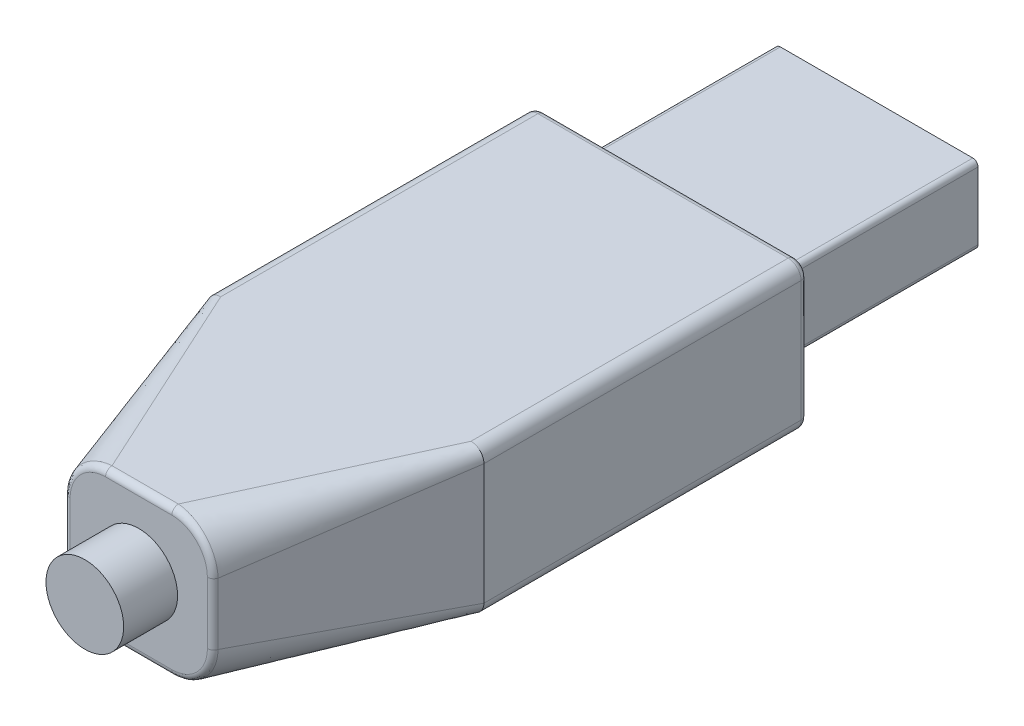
from build123d import *

# Parameters (mm, degrees)
SKETCH14_R           = 2.286
BOSS_EXTRUDE11_DEPTH = 3.175
BOSS_EXTRUDE13_DEPTH = 19.05
SKETCH24_W           = 11.938
SKETCH24_H           = 4.572
BOSS_EXTRUDE14_DEPTH = 12.192
SKETCH25_W           = 11.43
SKETCH25_H           = 2.286
CUT_EXTRUDE3_DEPTH   = 10.16
FILLET8_R            = 0.381
FILLET9_R            = 0.381
FILLET11_R           = 0.3048


with BuildPart() as part:
    # Sketch14 → Boss-Extrude11 (new body)
    with BuildSketch(Plane(origin=(0, 0, 101.6), x_dir=(0.9999999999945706, 3.2953024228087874e-06, 0), z_dir=(0, 2.2118574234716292e-10, 1.0))):
        with Locations(Location((-114.300004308, 16.1798, 0), (0, 0, 269.999811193))):
            Circle(SKETCH14_R)
    extrude(amount=-BOSS_EXTRUDE11_DEPTH)

    # Sketch21 for Boss-Loft1 → Boss-Loft1 section 0
    with BuildSketch(Plane(origin=(0, 2.2e-08, 98.425), x_dir=(-1, 0, 0), z_dir=(0, -2.2118574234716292e-10, -1.0))):
        with BuildLine():
            Line((112.522057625, 20.497423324), (116.078057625, 20.497423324))
            # circular arc as an exact rational Bezier (weights 1, cos(half-angle), 1)
            Bezier((116.078057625, 20.497423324), (118.618057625, 20.497423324), (118.618057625, 17.957423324), weights=[1, 0.707106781, 1])
            Line((118.618057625, 17.957423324), (118.618057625, 14.401423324))
            Bezier((118.618057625, 14.401423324), (118.618057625, 11.861423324), (116.078057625, 11.861423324), weights=[1, 0.707106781, 1])
            Line((116.078057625, 11.861423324), (112.522057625, 11.861423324))
            Bezier((112.522057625, 11.861423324), (109.982057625, 11.861423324), (109.982057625, 14.401423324), weights=[1, 0.707106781, 1])
            Line((109.982057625, 14.401423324), (109.982057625, 17.957423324))
            Bezier((109.982057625, 17.957423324), (109.982057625, 20.497423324), (112.522057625, 20.497423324), weights=[1, 0.707106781, 1])
        make_face()
    # Sketch22 for Boss-Loft1 → Boss-Loft1 section 1
    with BuildSketch(Plane(origin=(0, 1.9e-08, 86.233), x_dir=(-1, 0, 0), z_dir=(0, -2.2118574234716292e-10, -1.0))):
        with BuildLine():
            Line((106.934057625, 20.497423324), (121.666057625, 20.497423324))
            Bezier((121.666057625, 20.497423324), (122.428057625, 20.497423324), (122.428057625, 19.735423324), weights=[1, 0.707106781, 1])
            Line((122.428057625, 19.735423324), (122.428057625, 12.623423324))
            Bezier((122.428057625, 12.623423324), (122.428057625, 11.861423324), (121.666057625, 11.861423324), weights=[1, 0.707106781, 1])
            Line((121.666057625, 11.861423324), (106.934057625, 11.861423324))
            Bezier((106.934057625, 11.861423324), (106.172057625, 11.861423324), (106.172057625, 12.623423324), weights=[1, 0.707106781, 1])
            Line((106.172057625, 12.623423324), (106.172057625, 19.735423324))
            Bezier((106.172057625, 19.735423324), (106.172057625, 20.497423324), (106.934057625, 20.497423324), weights=[1, 0.707106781, 1])
        make_face()
    loft()

    # Sketch23 → Boss-Extrude13 (add)
    with BuildSketch(Plane(origin=(0, 1.9e-08, 86.233), x_dir=(-1, 0, 0), z_dir=(0, -2.2118574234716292e-10, -1.0))):
        with BuildLine():
            Line((122.428057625, 12.623423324), (122.428057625, 19.735423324))
            ThreePointArc((122.428057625, 19.735423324), (122.204872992, 20.274238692), (121.666057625, 20.497423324))
            Line((121.666057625, 20.497423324), (106.934057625, 20.497423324))
            ThreePointArc((106.934057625, 20.497423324), (106.395242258, 20.274238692), (106.172057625, 19.735423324))
            Line((106.172057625, 19.735423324), (106.172057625, 12.623423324))
            ThreePointArc((106.172057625, 12.623423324), (106.395242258, 12.084607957), (106.934057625, 11.861423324))
            Line((106.934057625, 11.861423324), (121.666057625, 11.861423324))
            ThreePointArc((121.666057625, 11.861423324), (122.204872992, 12.084607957), (122.428057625, 12.623423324))
        make_face()
    extrude(amount=BOSS_EXTRUDE13_DEPTH)

    # Sketch24 → Boss-Extrude14 (add)
    with BuildSketch(Plane(origin=(0, 1.5e-08, 67.183), x_dir=(-1, 0, 0), z_dir=(0, -2.2118574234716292e-10, -1.0))):
        with Locations((114.300057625, 16.179423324)):
            Rectangle(SKETCH24_W, SKETCH24_H)
    extrude(amount=BOSS_EXTRUDE14_DEPTH)

    # Sketch25 → Cut-Extrude3 (cut)
    with BuildSketch(Plane(origin=(0, 1.2e-08, 54.991), x_dir=(-1, 0, 0), z_dir=(0, -2.2118634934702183e-10, -1.0))):
        with Locations((114.300057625, 15.417423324)):
            Rectangle(SKETCH25_W, SKETCH25_H)
    extrude(amount=-CUT_EXTRUDE3_DEPTH, mode=Mode.SUBTRACT)

    # Fillet8
    fillet8_edges = [part.edges().sort_by_distance(p)[0] for p in [
        (-114.300057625, 11.861423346, 98.424999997),
        (-114.300057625, 20.497423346, 98.424999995),
        (-117.874109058, 19.753474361, 98.424999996),
        (-110.72600661, 19.753474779, 98.424999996),
        (-118.618057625, 16.179423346, 98.424999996),
        (-109.982057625, 16.179423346, 98.424999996),
        (-117.874108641, 12.605371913, 98.424999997),
        (-110.726006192, 12.605372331, 98.424999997),
    ]]
    fillet(fillet8_edges, radius=FILLET8_R)

    # Fillet9
    fillet9_edges = [part.edges().sort_by_distance(p)[0] for p in [
        (-122.204872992, 20.274238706, 67.182999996),
        (-114.300057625, 20.497423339, 67.182999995),
        (-106.395242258, 20.274238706, 67.182999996),
        (-106.172057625, 16.179423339, 67.182999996),
        (-106.395242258, 12.084607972, 67.182999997),
        (-114.300057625, 11.861423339, 67.182999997),
        (-122.204872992, 12.084607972, 67.182999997),
        (-122.428057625, 16.179423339, 67.182999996),
    ]]
    fillet(fillet9_edges, radius=FILLET9_R)

    # Fillet11
    fillet11_edges = [part.edges().sort_by_distance(p)[0] for p in [
        (-108.331057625, 18.465423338, 61.086999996),
        (-108.331057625, 13.893423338, 61.086999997),
        (-120.269057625, 13.893423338, 61.086999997),
        (-120.269057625, 18.465423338, 61.086999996),
    ]]
    fillet(fillet11_edges, radius=FILLET11_R)


solid = part.part
